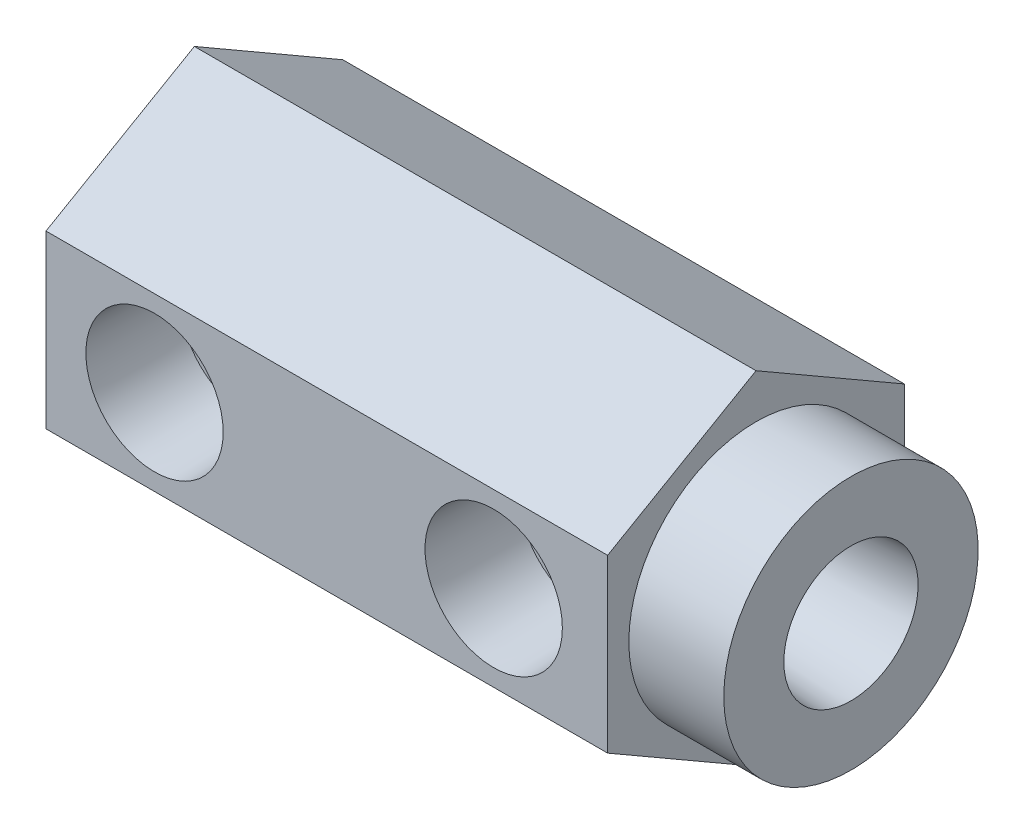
from build123d import *

# Parameters (mm, degrees)
BOSS_EXTRUDE1_DEPTH                = 42.0624
SKETCH2_R                          = 9.525
BOSS_EXTRUDE2_DEPTH                = 49.1744
F_1_8_NPT_TAPPED_HOLE1_AT_2_COUNT  = 2
F_1_8_NPT_TAPPED_HOLE1_AT_2_PITCH  = 25.4
F_21_0_159_DIAMETER_HOLE1_D        = 4.0386
F_21_0_159_DIAMETER_HOLE1_DEPTH    = 41.275
F_21_0_159_DIAMETER_HOLE1_TIP      = 1.213317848
F_3_16_0_1875_DIAMETER_HOLE1_D     = 4.7625
F_3_16_0_1875_DIAMETER_HOLE1_DEPTH = 29.972
F_3_16_0_1875_DIAMETER_HOLE1_TIP   = 1.430799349


with BuildPart() as part:
    # Sketch1 → Boss-Extrude1 (new body)
    with BuildSketch(Plane(origin=(0, 0, 0), x_dir=(0, 0, -1), z_dir=(1, 0, 0))):
        Polygon((-11.1125, -6.415804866), (0, -12.831609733), (11.1125, -6.415804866), (11.1125, 6.415804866), (0, 12.831609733), (-11.1125, 6.415804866), align=None)
    extrude(amount=BOSS_EXTRUDE1_DEPTH)

    # Sketch2 → Boss-Extrude2 (add)
    with BuildSketch(Plane.ZY):
        Circle(SKETCH2_R)
    extrude(amount=-BOSS_EXTRUDE2_DEPTH)

    # Sketch3 → 1_8 NPT Tapped Hole1 (revolve, cut)
    with BuildSketch(Plane(origin=(8.128, 0, 11.1125), x_dir=(0, -1, 0), z_dir=(1, 0, 0))):
        Polygon((0, 0), (0, 18.408468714), (4.2164, 15.875), (4.2164, 6.92404), (4.93618497, 6.92404), (5.1435, 0), align=None)
    f_1_8_npt_tapped_hole1 = revolve(axis=Axis((8.128, 0, 17.4625), (0, 0, -1)), mode=Mode.SUBTRACT)

    # 1_8 NPT Tapped Hole1 at 2: 1_8 NPT Tapped Hole1 ×2
    with Locations(*[(i * F_1_8_NPT_TAPPED_HOLE1_AT_2_PITCH, 0, 0) for i in range(1, F_1_8_NPT_TAPPED_HOLE1_AT_2_COUNT)]):
        add(f_1_8_npt_tapped_hole1, mode=Mode.SUBTRACT)

    # Sketch5 → 1_8 NPT Tapped Hole2 (revolve, cut)
    with BuildSketch(Plane(origin=(8.128, 0, -11.1125), x_dir=(0, 1, 0), z_dir=(1, 0, 0))):
        Polygon((0, 0), (0, 21.583468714), (4.2164, 19.05), (4.2164, 6.92404), (4.93618497, 6.92404), (5.1435, 0), align=None)
    revolve(axis=Axis((8.128, 0, -17.4625), (0, 0, 1)), mode=Mode.SUBTRACT)

    # 21 _0.159_ Diameter Hole1
    with Locations(Plane(origin=(49.1744, 0, 0), x_dir=(0, 0, -1), z_dir=(1, 0, 0))):
        with Locations((0, 0)):
            Hole(F_21_0_159_DIAMETER_HOLE1_D / 2, depth=F_21_0_159_DIAMETER_HOLE1_DEPTH)
            with Locations((0, 0, -(F_21_0_159_DIAMETER_HOLE1_DEPTH + F_21_0_159_DIAMETER_HOLE1_TIP / 2))):  # 118° drill point
                Cone(0, F_21_0_159_DIAMETER_HOLE1_D / 2, F_21_0_159_DIAMETER_HOLE1_TIP, mode=Mode.SUBTRACT)

    # 3_16 _0.1875_ Diameter Hole1
    with Locations(Plane(origin=(49.1744, 0, 0), x_dir=(0, 0, -1), z_dir=(1, 0, 0))):
        with Locations((0, 0)):
            Hole(F_3_16_0_1875_DIAMETER_HOLE1_D / 2, depth=F_3_16_0_1875_DIAMETER_HOLE1_DEPTH)
            with Locations((0, 0, -(F_3_16_0_1875_DIAMETER_HOLE1_DEPTH + F_3_16_0_1875_DIAMETER_HOLE1_TIP / 2))):  # 118° drill point
                Cone(0, F_3_16_0_1875_DIAMETER_HOLE1_D / 2, F_3_16_0_1875_DIAMETER_HOLE1_TIP, mode=Mode.SUBTRACT)

    # Sketch11 → Cut-Revolve1 (revolve, cut)
    with BuildSketch(Plane.XY, mode=Mode.PRIVATE) as cut_revolve1_sk:
        Polygon((49.1744, 0), (49.1744, 5.0292), (42.2402, 4.665793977), (42.2402, 4.3688), (26.9494, 4.3688), (26.9494, 0), align=None)
    revolve(cut_revolve1_sk.sketch.rotate(Axis((0, 0, 0), (1, 0, 0)), 90), axis=Axis((0, 0, 0), (1, 0, 0)), mode=Mode.SUBTRACT)


solid = part.part
